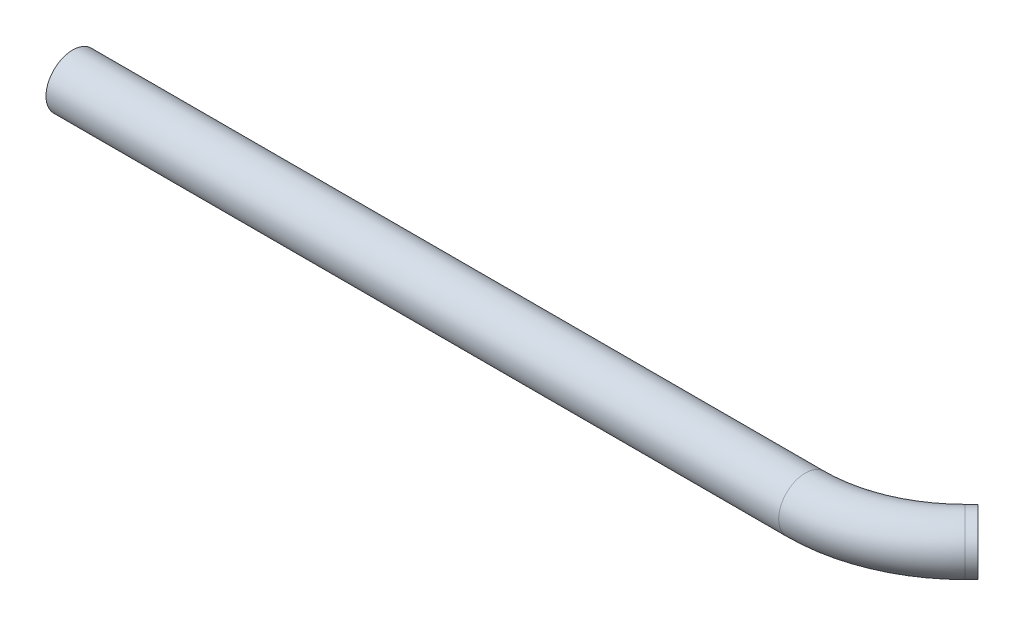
from build123d import *

# Parameters (mm, degrees)
SKETCH2_R = 0.79375


with BuildPart() as part:
    # Sweep1: sweep along a path in Sketch1
    with BuildLine(Plane(origin=(0, 0, 0), x_dir=(1, 0, 0), z_dir=(0, 1, 0))) as sweep1_path:
        Line((0, 0), (21.839807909, 0))
        ThreePointArc((21.839807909, 0), (23.662337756, 0.362523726), (25.207403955, 1.394903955))
        Line((25.207403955, 1.394903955), (25.4, 1.5875))
    # Sketch2 → Sweep1 (sweep)
    with BuildSketch(Plane(origin=(0, 0, 0), x_dir=(0, 0, -1), z_dir=(1, 0, 0))):
        Circle(SKETCH2_R)
    sweep(path=sweep1_path.line)


solid = part.part
